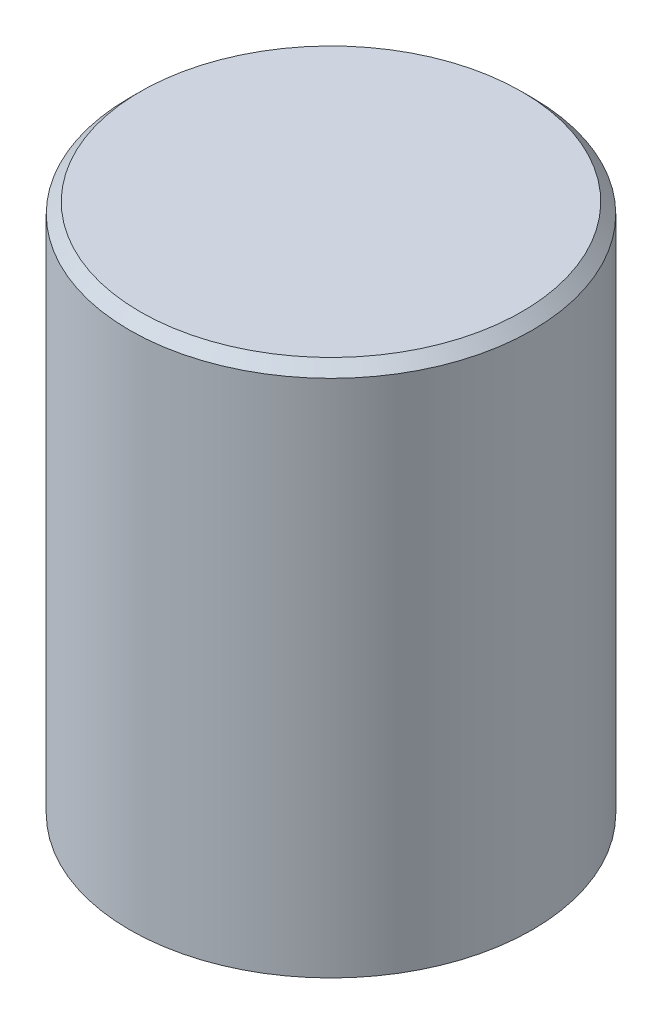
from build123d import *

# Parameters (mm, degrees)
CHAMFER1_SIZE = 1


with BuildPart() as part:
    # Sketch2 → Revolve1 (revolve)
    with BuildSketch(Plane.XY, mode=Mode.PRIVATE) as revolve1_sk:
        Polygon((-19, 0), (-17, 0), (-17, 2), (-14, 2), (-14, 45), (0, 45), (0, 50), (-19, 50), align=None)
    revolve(revolve1_sk.sketch.rotate(Axis((0, 0, 0), (0, 1, 0)), 270), axis=Axis((0, 0, 0), (0, 1, 0)))

    # Chamfer1
    chamfer1_edges = [part.edges().sort_by_distance(p)[0] for p in [
        (0, 50, 19),
    ]]
    chamfer(chamfer1_edges, length=CHAMFER1_SIZE)


solid = part.part
